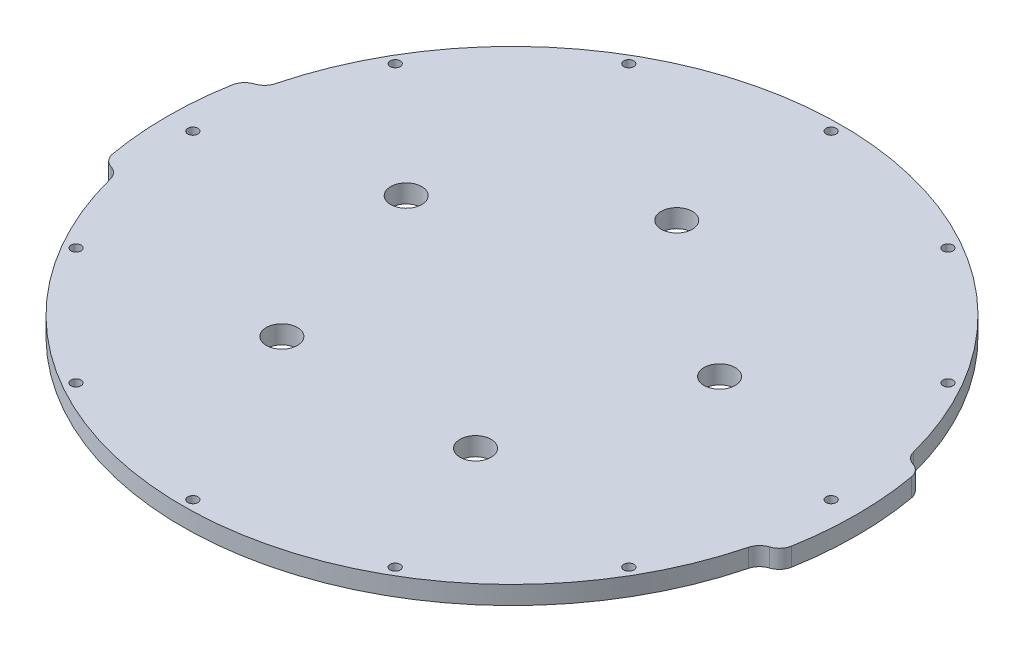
from build123d import *

# Parameters (mm, degrees)
SKETCH1_R           = 1.65
BOSS_EXTRUDE1_DEPTH = 6
FILLET1_R           = 5
SKETCH2_R           = 5.1
CUT_EXTRUDE1_DEPTH  = 157.355060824


with BuildPart() as part:
    # Sketch1 → Boss-Extrude1 (new body)
    with BuildSketch(Plane(origin=(0, 0, 0), x_dir=(1, 0, 0), z_dir=(0, 1, 0))):
        with BuildLine():
            ThreePointArc((-111.234035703, -19.613561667), (-112.95, 0), (-111.234035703, 19.613561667))
            ThreePointArc((-111.234035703, 19.613561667), (-109.13025705, 22.87401705), (-105.327953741, 23.647931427))
            ThreePointArc((-105.327953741, 23.647931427), (0, 107.95), (105.327953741, 23.647931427))
            ThreePointArc((105.327953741, 23.647931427), (109.13025705, 22.87401705), (111.234035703, 19.613561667))
            ThreePointArc((111.234035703, 19.613561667), (112.95, 0), (111.234035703, -19.613561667))
            ThreePointArc((111.234035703, -19.613561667), (109.13025705, -22.87401705), (105.327953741, -23.647931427))
            ThreePointArc((105.327953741, -23.647931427), (0, -107.95), (-105.327953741, -23.647931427))
            ThreePointArc((-105.327953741, -23.647931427), (-109.13025705, -22.87401705), (-111.234035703, -19.613561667))
        make_face()
        with Locations(Location((0, 104.55, 0), (0, 0, 270))):
            Circle(SKETCH1_R, mode=Mode.SUBTRACT)
        with Locations(Location((52.275, 90.542955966, 0), (0, 0, 270))):
            Circle(SKETCH1_R, mode=Mode.SUBTRACT)
        with Locations(Location((90.542955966, 52.275, 0), (0, 0, 270))):
            Circle(SKETCH1_R, mode=Mode.SUBTRACT)
        with Locations(Location((104.55, 0, 0), (0, 0, 270))):
            Circle(SKETCH1_R, mode=Mode.SUBTRACT)
        with Locations(Location((90.542955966, -52.275, 0), (0, 0, 270))):
            Circle(SKETCH1_R, mode=Mode.SUBTRACT)
        with Locations(Location((52.275, -90.542955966, 0), (0, 0, 270))):
            Circle(SKETCH1_R, mode=Mode.SUBTRACT)
        with Locations(Location((0, -104.55, 0), (0, 0, 270))):
            Circle(SKETCH1_R, mode=Mode.SUBTRACT)
        with Locations(Location((-52.275, -90.542955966, 0), (0, 0, 270))):
            Circle(SKETCH1_R, mode=Mode.SUBTRACT)
        with Locations(Location((-90.542955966, -52.275, 0), (0, 0, 270))):
            Circle(SKETCH1_R, mode=Mode.SUBTRACT)
        with Locations(Location((-104.55, 0, 0), (0, 0, 270))):
            Circle(SKETCH1_R, mode=Mode.SUBTRACT)
        with Locations(Location((-90.542955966, 52.275, 0), (0, 0, 270))):
            Circle(SKETCH1_R, mode=Mode.SUBTRACT)
        with Locations(Location((-52.275, 90.542955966, 0), (0, 0, 270))):
            Circle(SKETCH1_R, mode=Mode.SUBTRACT)
    extrude(amount=BOSS_EXTRUDE1_DEPTH)

    # Fillet1
    fillet1_edges = [part.edges().sort_by_distance(p)[0] for p in [
        (-105.327953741, 3, -23.647931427),
        (105.327953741, 3, -23.647931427),
        (105.327953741, 3, 23.647931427),
        (-105.327953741, 3, 23.647931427),
    ]]
    fillet(fillet1_edges, radius=FILLET1_R)

    # Sketch2 → Cut-Extrude1 (cut, through all)
    with BuildSketch(Plane(origin=(0, 6, 0), x_dir=(1, 0, 0), z_dir=(0, 1, 0))):
        with Locations(Location((0, 53.975, 0), (0, 0, 270))):
            Circle(SKETCH2_R)
        with Locations(Location((51.333275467, 16.679192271, 0), (0, 0, 270))):
            Circle(SKETCH2_R)
        with Locations(Location((31.725708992, -43.666692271, 0), (0, 0, 270))):
            Circle(SKETCH2_R)
        with Locations(Location((-31.725708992, -43.666692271, 0), (0, 0, 270))):
            Circle(SKETCH2_R)
        with Locations(Location((-51.333275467, 16.679192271, 0), (0, 0, 270))):
            Circle(SKETCH2_R)
    extrude(amount=-CUT_EXTRUDE1_DEPTH, mode=Mode.SUBTRACT)


solid = part.part
